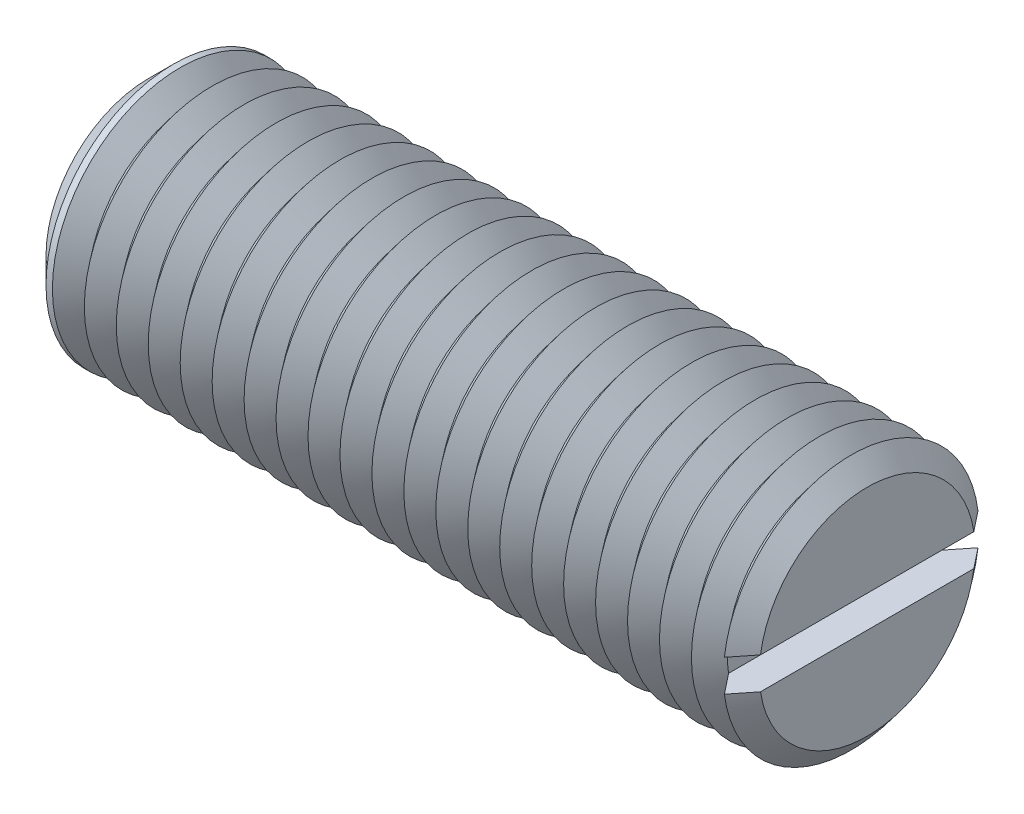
from build123d import *

# Parameters (mm, degrees)
SKETCH1_R       = 8
EXTRUDE1_DEPTH  = 22.5
SKETCH2_W       = 2
SKETCH2_H       = 2
EXTRUDE2_DEPTH  = 12
CHAMFER1_SIZE   = 1.6
LPATTERN1_COUNT = 22
LPATTERN1_PITCH = 2


with BuildPart() as part:
    # Sketch1 → Extrude1 (new, symmetric)
    with BuildSketch(Plane(origin=(0, 0, 0), x_dir=(0, 0, -1), z_dir=(1, 0, 0))):
        with Locations(Location((0, 0, 0), (0, 0, 180))):
            Circle(SKETCH1_R)
    extrude(amount=EXTRUDE1_DEPTH, both=True)

    # Sketch2 → Extrude2 (cut, symmetric)
    with BuildSketch(Plane.XY):
        with Locations((21.5, 0)):
            Rectangle(SKETCH2_W, SKETCH2_H)
    extrude(amount=EXTRUDE2_DEPTH, both=True, mode=Mode.SUBTRACT)

    # Chamfer1
    chamfer1_edges = [part.edges().sort_by_distance(p)[0] for p in [
        (-22.5, 0, -8),
    ]]
    chamfer(chamfer1_edges, length=CHAMFER1_SIZE)

    # Sketch3 → Cut-Revolve1 (revolve, cut)
    with BuildSketch(Plane.XY, mode=Mode.PRIVATE) as cut_revolve1_sk:
        Polygon((21.5, -8), (23.5, -8), (22.5, -6.7510004), align=None)
    cut_revolve1 = revolve(cut_revolve1_sk.sketch.rotate(Axis((0, 0, 0), (1, 0, 0)), 277.180755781), axis=Axis((0, 0, 0), (1, 0, 0)), mode=Mode.SUBTRACT)

    # LPattern1: Cut-Revolve1 ×22
    with Locations(*[(-i * LPATTERN1_PITCH, 0, 0) for i in range(1, LPATTERN1_COUNT)]):
        add(cut_revolve1, mode=Mode.SUBTRACT)


solid = part.part
